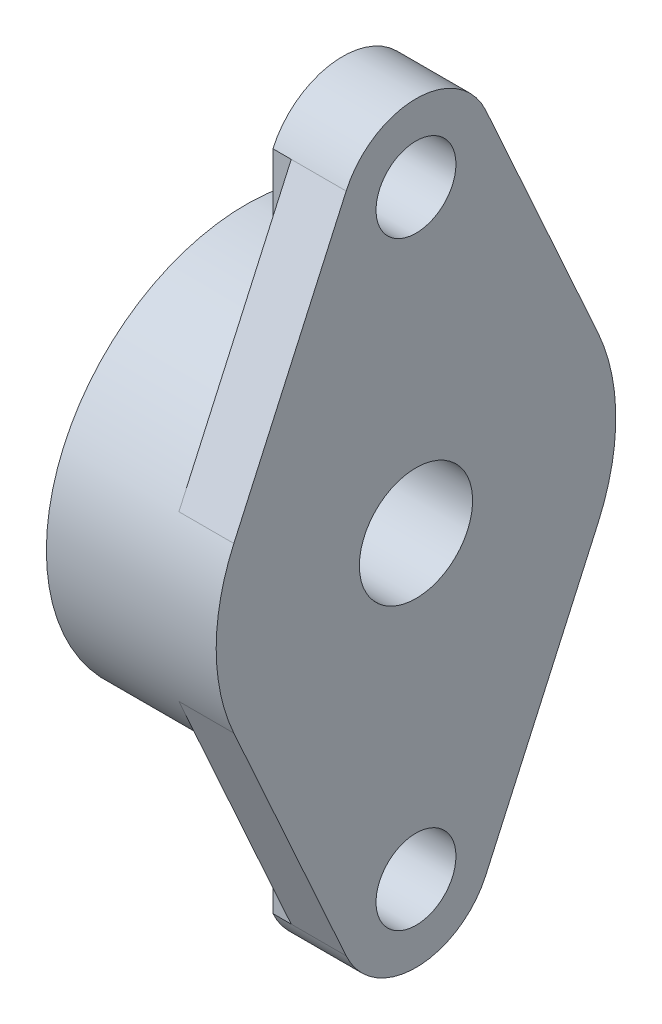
ISO-10303-21;
HEADER;
FILE_DESCRIPTION(('STEP AP214'),'2;1');
FILE_NAME('part.step','',(''),(''),'','','');
FILE_SCHEMA(('AUTOMOTIVE_DESIGN { 1 0 10303 214 1 1 1 1 }'));
ENDSEC;
DATA;
#1=APPLICATION_CONTEXT('core data for automotive mechanical design processes');
#2=APPLICATION_PROTOCOL_DEFINITION('international standard','automotive_design',2000,#1);
#3=PRODUCT_CONTEXT('',#1,'mechanical');
#4=PRODUCT('Part','Part','',(#3));
#5=PRODUCT_RELATED_PRODUCT_CATEGORY('part','',(#4));
#6=PRODUCT_DEFINITION_FORMATION('','',#4);
#7=PRODUCT_DEFINITION_CONTEXT('part definition',#1,'design');
#8=PRODUCT_DEFINITION('design','',#6,#7);
#9=PRODUCT_DEFINITION_SHAPE('','',#8);
#10=(LENGTH_UNIT() NAMED_UNIT(*) SI_UNIT(.MILLI.,.METRE.));
#11=(NAMED_UNIT(*) PLANE_ANGLE_UNIT() SI_UNIT($,.RADIAN.));
#12=(NAMED_UNIT(*) SI_UNIT($,.STERADIAN.) SOLID_ANGLE_UNIT());
#13=UNCERTAINTY_MEASURE_WITH_UNIT(LENGTH_MEASURE(1.E-05),#10,'distance_accuracy_value','');
#14=(GEOMETRIC_REPRESENTATION_CONTEXT(3) GLOBAL_UNCERTAINTY_ASSIGNED_CONTEXT((#13)) GLOBAL_UNIT_ASSIGNED_CONTEXT((#10,
#11,#12)) REPRESENTATION_CONTEXT('',''));
#15=CARTESIAN_POINT('',(0.,0.,0.));
#16=DIRECTION('',(0.,0.,1.));
#17=DIRECTION('',(1.,0.,0.));
#18=AXIS2_PLACEMENT_3D('',#15,#16,#17);
#19=CARTESIAN_POINT('',(-8.25,-49.9521254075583,-27.3475572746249));
#20=DIRECTION('',(-1.,0.,0.));
#21=DIRECTION('',(0.,0.,1.));
#22=AXIS2_PLACEMENT_3D('',#19,#20,#21);
#23=PLANE('',#22);
#24=DIRECTION('',(0.,-1.,0.));
#25=VECTOR('',#24,1.);
#26=CARTESIAN_POINT('',(-8.25,-38.9182643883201,-10.4832302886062));
#27=LINE('',#26,#25);
#28=CARTESIAN_POINT('',(-8.25,-28.1087509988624,-10.4832302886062));
#29=VERTEX_POINT('',#28);
#30=CARTESIAN_POINT('',(-8.25,-49.7277777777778,-10.4832302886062));
#31=VERTEX_POINT('',#30);
#32=EDGE_CURVE('E71',#29,#31,#27,.T.);
#33=ORIENTED_EDGE('',*,*,#32,.F.);
#34=CARTESIAN_POINT('',(-8.25,0.,0.));
#35=DIRECTION('',(-1.,0.,0.));
#36=DIRECTION('',(0.,0.,1.));
#37=AXIS2_PLACEMENT_3D('',#34,#35,#36);
#38=CIRCLE('',#37,30.);
#39=CARTESIAN_POINT('',(-8.25,-12.3365061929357,-27.3461262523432));
#40=VERTEX_POINT('',#39);
#41=EDGE_CURVE('E208',#40,#29,#38,.T.);
#42=ORIENTED_EDGE('',*,*,#41,.F.);
#43=DIRECTION('',(0.,0.911585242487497,-0.411111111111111));
#44=VECTOR('',#43,1.);
#45=CARTESIAN_POINT('',(-8.25,-31.0305555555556,-18.9153937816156));
#46=LINE('',#45,#44);
#47=EDGE_CURVE('E308',#31,#40,#46,.T.);
#48=ORIENTED_EDGE('',*,*,#47,.F.);
#49=EDGE_LOOP('',(#33,#42,#48));
#50=FACE_BOUND('',#49,.T.);
#51=ADVANCED_FACE('F16',(#50),#23,.T.);
#52=CARTESIAN_POINT('',(-11.,-49.7277777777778,-10.4832302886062));
#53=DIRECTION('',(0.,0.,-1.));
#54=DIRECTION('',(0.,1.,0.));
#55=AXIS2_PLACEMENT_3D('',#52,#53,#54);
#56=PLANE('',#55);
#57=DIRECTION('',(0.,-1.,0.));
#58=VECTOR('',#57,1.);
#59=CARTESIAN_POINT('',(-11.,-42.4463317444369,-10.4832302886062));
#60=LINE('',#59,#58);
#61=CARTESIAN_POINT('',(-11.,-28.1087509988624,-10.4832302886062));
#62=VERTEX_POINT('',#61);
#63=CARTESIAN_POINT('',(-11.,-49.7277777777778,-10.4832302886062));
#64=VERTEX_POINT('',#63);
#65=EDGE_CURVE('E65',#62,#64,#60,.T.);
#66=ORIENTED_EDGE('',*,*,#65,.F.);
#67=DIRECTION('',(-1.,0.,0.));
#68=VECTOR('',#67,1.);
#69=CARTESIAN_POINT('',(-12.75,-28.1087509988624,-10.4832302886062));
#70=LINE('',#69,#68);
#71=EDGE_CURVE('E300',#29,#62,#70,.T.);
#72=ORIENTED_EDGE('',*,*,#71,.F.);
#73=ORIENTED_EDGE('',*,*,#32,.T.);
#74=DIRECTION('',(1.,0.,0.));
#75=VECTOR('',#74,1.);
#76=CARTESIAN_POINT('',(-5.5,-49.7277777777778,-10.4832302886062));
#77=LINE('',#76,#75);
#78=EDGE_CURVE('E316',#64,#31,#77,.T.);
#79=ORIENTED_EDGE('',*,*,#78,.F.);
#80=EDGE_LOOP('',(#66,#72,#73,#79));
#81=FACE_BOUND('',#80,.T.);
#82=ADVANCED_FACE('F482',(#81),#56,.T.);
#83=CARTESIAN_POINT('',(-8.25,12.1121584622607,-27.3475572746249));
#84=DIRECTION('',(-1.,0.,0.));
#85=DIRECTION('',(0.,0.,1.));
#86=AXIS2_PLACEMENT_3D('',#83,#84,#85);
#87=PLANE('',#86);
#88=CARTESIAN_POINT('',(-8.25,0.,0.));
#89=DIRECTION('',(-1.,0.,0.));
#90=DIRECTION('',(0.,0.,1.));
#91=AXIS2_PLACEMENT_3D('',#88,#89,#90);
#92=CIRCLE('',#91,30.);
#93=CARTESIAN_POINT('',(-8.25,28.1087509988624,-10.4832302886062));
#94=VERTEX_POINT('',#93);
#95=CARTESIAN_POINT('',(-8.25,12.3365061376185,-27.3461262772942));
#96=VERTEX_POINT('',#95);
#97=EDGE_CURVE('E360',#94,#96,#92,.T.);
#98=ORIENTED_EDGE('',*,*,#97,.F.);
#99=DIRECTION('',(0.,-1.,0.));
#100=VECTOR('',#99,1.);
#101=CARTESIAN_POINT('',(-8.25,38.9182643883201,-10.4832302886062));
#102=LINE('',#101,#100);
#103=CARTESIAN_POINT('',(-8.25,49.7277777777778,-10.4832302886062));
#104=VERTEX_POINT('',#103);
#105=EDGE_CURVE('E270',#104,#94,#102,.T.);
#106=ORIENTED_EDGE('',*,*,#105,.F.);
#107=DIRECTION('',(0.,0.911585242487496,0.411111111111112));
#108=VECTOR('',#107,1.);
#109=CARTESIAN_POINT('',(-8.25,31.0305555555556,-18.9153937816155));
#110=LINE('',#109,#108);
#111=EDGE_CURVE('E203',#96,#104,#110,.T.);
#112=ORIENTED_EDGE('',*,*,#111,.F.);
#113=EDGE_LOOP('',(#98,#106,#112));
#114=FACE_BOUND('',#113,.T.);
#115=ADVANCED_FACE('F371',(#114),#87,.T.);
#116=CARTESIAN_POINT('',(-11.,28.1087509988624,-10.4832302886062));
#117=DIRECTION('',(0.,0.,-1.));
#118=DIRECTION('',(0.,1.,0.));
#119=AXIS2_PLACEMENT_3D('',#116,#117,#118);
#120=PLANE('',#119);
#121=DIRECTION('',(0.,-1.,0.));
#122=VECTOR('',#121,1.);
#123=CARTESIAN_POINT('',(-11.,42.4463317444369,-10.4832302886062));
#124=LINE('',#123,#122);
#125=CARTESIAN_POINT('',(-11.,49.7277777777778,-10.4832302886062));
#126=VERTEX_POINT('',#125);
#127=CARTESIAN_POINT('',(-11.,28.1087509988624,-10.4832302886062));
#128=VERTEX_POINT('',#127);
#129=EDGE_CURVE('E245',#126,#128,#124,.T.);
#130=ORIENTED_EDGE('',*,*,#129,.F.);
#131=DIRECTION('',(-1.,0.,0.));
#132=VECTOR('',#131,1.);
#133=CARTESIAN_POINT('',(-5.5,49.7277777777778,-10.4832302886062));
#134=LINE('',#133,#132);
#135=EDGE_CURVE('E197',#104,#126,#134,.T.);
#136=ORIENTED_EDGE('',*,*,#135,.F.);
#137=ORIENTED_EDGE('',*,*,#105,.T.);
#138=DIRECTION('',(1.,0.,0.));
#139=VECTOR('',#138,1.);
#140=CARTESIAN_POINT('',(-12.75,28.1087509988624,-10.4832302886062));
#141=LINE('',#140,#139);
#142=EDGE_CURVE('E215',#128,#94,#141,.T.);
#143=ORIENTED_EDGE('',*,*,#142,.F.);
#144=EDGE_LOOP('',(#130,#136,#137,#143));
#145=FACE_BOUND('',#144,.T.);
#146=ADVANCED_FACE('F366',(#145),#120,.T.);
#147=CARTESIAN_POINT('',(-11.,-28.1087509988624,10.4832302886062));
#148=DIRECTION('',(0.,0.,1.));
#149=DIRECTION('',(0.,-1.,0.));
#150=AXIS2_PLACEMENT_3D('',#147,#148,#149);
#151=PLANE('',#150);
#152=DIRECTION('',(0.,1.,0.));
#153=VECTOR('',#152,1.);
#154=CARTESIAN_POINT('',(-11.,-42.4463317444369,10.4832302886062));
#155=LINE('',#154,#153);
#156=CARTESIAN_POINT('',(-11.,-49.7277777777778,10.4832302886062));
#157=VERTEX_POINT('',#156);
#158=CARTESIAN_POINT('',(-11.,-28.1087509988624,10.4832302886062));
#159=VERTEX_POINT('',#158);
#160=EDGE_CURVE('E59',#157,#159,#155,.T.);
#161=ORIENTED_EDGE('',*,*,#160,.F.);
#162=DIRECTION('',(-1.,0.,0.));
#163=VECTOR('',#162,1.);
#164=CARTESIAN_POINT('',(-5.5,-49.7277777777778,10.4832302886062));
#165=LINE('',#164,#163);
#166=CARTESIAN_POINT('',(-8.25,-49.7277777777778,10.4832302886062));
#167=VERTEX_POINT('',#166);
#168=EDGE_CURVE('E257',#167,#157,#165,.T.);
#169=ORIENTED_EDGE('',*,*,#168,.F.);
#170=DIRECTION('',(0.,1.,0.));
#171=VECTOR('',#170,1.);
#172=CARTESIAN_POINT('',(-8.25,-49.7277777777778,10.4832302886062));
#173=LINE('',#172,#171);
#174=CARTESIAN_POINT('',(-8.25,-28.1087509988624,10.4832302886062));
#175=VERTEX_POINT('',#174);
#176=EDGE_CURVE('E251',#175,#167,#173,.F.);
#177=ORIENTED_EDGE('',*,*,#176,.F.);
#178=DIRECTION('',(1.,0.,0.));
#179=VECTOR('',#178,1.);
#180=CARTESIAN_POINT('',(-12.75,-28.1087509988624,10.4832302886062));
#181=LINE('',#180,#179);
#182=EDGE_CURVE('E277',#159,#175,#181,.T.);
#183=ORIENTED_EDGE('',*,*,#182,.F.);
#184=EDGE_LOOP('',(#161,#169,#177,#183));
#185=FACE_BOUND('',#184,.T.);
#186=ADVANCED_FACE('F432',(#185),#151,.T.);
#187=CARTESIAN_POINT('',(-8.25,12.1121585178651,10.4832302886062));
#188=DIRECTION('',(-1.,0.,0.));
#189=DIRECTION('',(0.,0.,1.));
#190=AXIS2_PLACEMENT_3D('',#187,#188,#189);
#191=PLANE('',#190);
#192=DIRECTION('',(0.,1.,0.));
#193=VECTOR('',#192,1.);
#194=CARTESIAN_POINT('',(-8.25,38.9182643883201,10.4832302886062));
#195=LINE('',#194,#193);
#196=CARTESIAN_POINT('',(-8.25,28.1087509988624,10.4832302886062));
#197=VERTEX_POINT('',#196);
#198=CARTESIAN_POINT('',(-8.25,49.7277777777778,10.4832302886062));
#199=VERTEX_POINT('',#198);
#200=EDGE_CURVE('E133',#197,#199,#195,.T.);
#201=ORIENTED_EDGE('',*,*,#200,.F.);
#202=CARTESIAN_POINT('',(-8.25,0.,0.));
#203=DIRECTION('',(-1.,0.,0.));
#204=DIRECTION('',(0.,0.,1.));
#205=AXIS2_PLACEMENT_3D('',#202,#203,#204);
#206=CIRCLE('',#205,30.);
#207=CARTESIAN_POINT('',(-8.25,12.3365061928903,27.3461262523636));
#208=VERTEX_POINT('',#207);
#209=EDGE_CURVE('E184',#208,#197,#206,.T.);
#210=ORIENTED_EDGE('',*,*,#209,.F.);
#211=DIRECTION('',(0.,-0.911585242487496,0.411111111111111));
#212=VECTOR('',#211,1.);
#213=CARTESIAN_POINT('',(-8.25,31.0305555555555,18.9153937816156));
#214=LINE('',#213,#212);
#215=EDGE_CURVE('E274',#199,#208,#214,.T.);
#216=ORIENTED_EDGE('',*,*,#215,.F.);
#217=EDGE_LOOP('',(#201,#210,#216));
#218=FACE_BOUND('',#217,.T.);
#219=ADVANCED_FACE('F420',(#218),#191,.T.);
#220=CARTESIAN_POINT('',(-11.,49.7277777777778,10.4832302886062));
#221=DIRECTION('',(0.,0.,1.));
#222=DIRECTION('',(0.,-1.,0.));
#223=AXIS2_PLACEMENT_3D('',#220,#221,#222);
#224=PLANE('',#223);
#225=DIRECTION('',(0.,1.,0.));
#226=VECTOR('',#225,1.);
#227=CARTESIAN_POINT('',(-11.,42.4463317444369,10.4832302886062));
#228=LINE('',#227,#226);
#229=CARTESIAN_POINT('',(-11.,28.1087509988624,10.4832302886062));
#230=VERTEX_POINT('',#229);
#231=CARTESIAN_POINT('',(-11.,49.7277777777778,10.4832302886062));
#232=VERTEX_POINT('',#231);
#233=EDGE_CURVE('E128',#230,#232,#228,.T.);
#234=ORIENTED_EDGE('',*,*,#233,.F.);
#235=DIRECTION('',(-1.,0.,0.));
#236=VECTOR('',#235,1.);
#237=CARTESIAN_POINT('',(-12.75,28.1087509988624,10.4832302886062));
#238=LINE('',#237,#236);
#239=EDGE_CURVE('E267',#197,#230,#238,.T.);
#240=ORIENTED_EDGE('',*,*,#239,.F.);
#241=ORIENTED_EDGE('',*,*,#200,.T.);
#242=DIRECTION('',(1.,0.,0.));
#243=VECTOR('',#242,1.);
#244=CARTESIAN_POINT('',(-5.5,49.7277777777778,10.4832302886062));
#245=LINE('',#244,#243);
#246=EDGE_CURVE('E284',#232,#199,#245,.T.);
#247=ORIENTED_EDGE('',*,*,#246,.F.);
#248=EDGE_LOOP('',(#234,#240,#241,#247));
#249=FACE_BOUND('',#248,.T.);
#250=ADVANCED_FACE('F424',(#249),#224,.T.);
#251=CARTESIAN_POINT('',(-8.25,-49.9521254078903,10.4832302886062));
#252=DIRECTION('',(-1.,0.,0.));
#253=DIRECTION('',(0.,0.,1.));
#254=AXIS2_PLACEMENT_3D('',#251,#252,#253);
#255=PLANE('',#254);
#256=CARTESIAN_POINT('',(-8.25,0.,0.));
#257=DIRECTION('',(-1.,0.,0.));
#258=DIRECTION('',(0.,0.,1.));
#259=AXIS2_PLACEMENT_3D('',#256,#257,#258);
#260=CIRCLE('',#259,30.);
#261=CARTESIAN_POINT('',(-8.25,-12.3365061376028,27.3461262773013));
#262=VERTEX_POINT('',#261);
#263=EDGE_CURVE('E154',#175,#262,#260,.T.);
#264=ORIENTED_EDGE('',*,*,#263,.F.);
#265=ORIENTED_EDGE('',*,*,#176,.T.);
#266=DIRECTION('',(0.,-0.911585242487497,-0.411111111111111));
#267=VECTOR('',#266,1.);
#268=CARTESIAN_POINT('',(-8.25,-31.0305555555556,18.9153937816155));
#269=LINE('',#268,#267);
#270=EDGE_CURVE('E171',#262,#167,#269,.T.);
#271=ORIENTED_EDGE('',*,*,#270,.F.);
#272=EDGE_LOOP('',(#264,#265,#271));
#273=FACE_BOUND('',#272,.T.);
#274=ADVANCED_FACE('F238',(#273),#255,.T.);
#275=CARTESIAN_POINT('',(-11.,28.1087509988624,10.4832302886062));
#276=CARTESIAN_POINT('',(-11.,56.5,10.4832302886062));
#277=CARTESIAN_POINT('',(-11.,56.7839124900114,10.4832302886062));
#278=B_SPLINE_CURVE_WITH_KNOTS('',1,(#275,#276,#277),.UNSPECIFIED.,.F.,.F.,(2,1,2),(0.,1.,1.01),.UNSPECIFIED.);
#279=DIRECTION('',(0.,0.,-1.));
#280=VECTOR('',#279,1.);
#281=SURFACE_OF_LINEAR_EXTRUSION('',#278,#280);
#282=CARTESIAN_POINT('',(-11.,45.,0.));
#283=DIRECTION('',(1.,0.,0.));
#284=DIRECTION('',(0.,0.,-1.));
#285=AXIS2_PLACEMENT_3D('',#282,#283,#284);
#286=CIRCLE('',#285,6.00000000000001);
#287=CARTESIAN_POINT('',(-11.,45.,-6.00000000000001));
#288=VERTEX_POINT('',#287);
#289=EDGE_CURVE('E165',#288,#288,#286,.F.);
#290=ORIENTED_EDGE('',*,*,#289,.F.);
#291=EDGE_LOOP('',(#290));
#292=FACE_BOUND('',#291,.T.);
#293=ORIENTED_EDGE('',*,*,#129,.T.);
#294=CARTESIAN_POINT('',(-11.,0.,0.));
#295=DIRECTION('',(-1.,0.,0.));
#296=DIRECTION('',(0.,0.,1.));
#297=AXIS2_PLACEMENT_3D('',#294,#295,#296);
#298=CIRCLE('',#297,30.);
#299=EDGE_CURVE('E261',#230,#128,#298,.T.);
#300=ORIENTED_EDGE('',*,*,#299,.F.);
#301=ORIENTED_EDGE('',*,*,#233,.T.);
#302=CARTESIAN_POINT('',(-11.,45.,0.));
#303=DIRECTION('',(1.,0.,0.));
#304=DIRECTION('',(0.,0.,-1.));
#305=AXIS2_PLACEMENT_3D('',#302,#303,#304);
#306=CIRCLE('',#305,11.5);
#307=EDGE_CURVE('E288',#126,#232,#306,.T.);
#308=ORIENTED_EDGE('',*,*,#307,.F.);
#309=EDGE_LOOP('',(#293,#300,#301,#308));
#310=FACE_BOUND('',#309,.T.);
#311=ADVANCED_FACE('F232',(#292,#310),#281,.T.);
#312=CARTESIAN_POINT('',(-11.,-56.7839124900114,10.4832302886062));
#313=CARTESIAN_POINT('',(-11.,-56.5,10.4832302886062));
#314=CARTESIAN_POINT('',(-11.,-28.1087509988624,10.4832302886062));
#315=B_SPLINE_CURVE_WITH_KNOTS('',1,(#312,#313,#314),.UNSPECIFIED.,.F.,.F.,(2,1,2),(-0.01,0.,
1.),.UNSPECIFIED.);
#316=DIRECTION('',(0.,0.,-1.));
#317=VECTOR('',#316,1.);
#318=SURFACE_OF_LINEAR_EXTRUSION('',#315,#317);
#319=CARTESIAN_POINT('',(-11.,-45.,0.));
#320=DIRECTION('',(1.,0.,0.));
#321=DIRECTION('',(0.,0.,-1.));
#322=AXIS2_PLACEMENT_3D('',#319,#320,#321);
#323=CIRCLE('',#322,6.);
#324=CARTESIAN_POINT('',(-11.,-45.,-6.));
#325=VERTEX_POINT('',#324);
#326=EDGE_CURVE('E169',#325,#325,#323,.F.);
#327=ORIENTED_EDGE('',*,*,#326,.F.);
#328=EDGE_LOOP('',(#327));
#329=FACE_BOUND('',#328,.T.);
#330=ORIENTED_EDGE('',*,*,#65,.T.);
#331=CARTESIAN_POINT('',(-11.,-45.,0.));
#332=DIRECTION('',(1.,0.,0.));
#333=DIRECTION('',(0.,0.,-1.));
#334=AXIS2_PLACEMENT_3D('',#331,#332,#333);
#335=CIRCLE('',#334,11.5);
#336=EDGE_CURVE('E19',#157,#64,#335,.T.);
#337=ORIENTED_EDGE('',*,*,#336,.F.);
#338=ORIENTED_EDGE('',*,*,#160,.T.);
#339=CARTESIAN_POINT('',(-11.,0.,0.));
#340=DIRECTION('',(-1.,0.,0.));
#341=DIRECTION('',(0.,0.,1.));
#342=AXIS2_PLACEMENT_3D('',#339,#340,#341);
#343=CIRCLE('',#342,30.);
#344=EDGE_CURVE('E353',#62,#159,#343,.T.);
#345=ORIENTED_EDGE('',*,*,#344,.F.);
#346=EDGE_LOOP('',(#330,#337,#338,#345));
#347=FACE_BOUND('',#346,.T.);
#348=ADVANCED_FACE('F227',(#329,#347),#318,.T.);
#349=CARTESIAN_POINT('',(-25.5,-30.,30.3600010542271));
#350=DIRECTION('',(-1.,0.,0.));
#351=DIRECTION('',(0.,1.,0.));
#352=AXIS2_PLACEMENT_3D('',#349,#350,#351);
#353=PLANE('',#352);
#354=CARTESIAN_POINT('',(-25.5,0.,0.));
#355=DIRECTION('',(-1.,0.,0.));
#356=DIRECTION('',(0.,0.,1.));
#357=AXIS2_PLACEMENT_3D('',#354,#355,#356);
#358=CIRCLE('',#357,12.75);
#359=CARTESIAN_POINT('',(-25.5,0.,12.75));
#360=VERTEX_POINT('',#359);
#361=EDGE_CURVE('E344',#360,#360,#358,.T.);
#362=ORIENTED_EDGE('',*,*,#361,.F.);
#363=EDGE_LOOP('',(#362));
#364=FACE_BOUND('',#363,.T.);
#365=CARTESIAN_POINT('',(-25.5,0.,0.));
#366=DIRECTION('',(-1.,0.,0.));
#367=DIRECTION('',(0.,0.,1.));
#368=AXIS2_PLACEMENT_3D('',#365,#366,#367);
#369=CIRCLE('',#368,30.);
#370=CARTESIAN_POINT('',(-25.5,0.,30.));
#371=VERTEX_POINT('',#370);
#372=EDGE_CURVE('E190',#371,#371,#369,.F.);
#373=ORIENTED_EDGE('',*,*,#372,.F.);
#374=EDGE_LOOP('',(#373));
#375=FACE_BOUND('',#374,.T.);
#376=ADVANCED_FACE('F231',(#364,#375),#353,.T.);
#377=CARTESIAN_POINT('',(0.,-45.,0.));
#378=DIRECTION('',(1.,0.,0.));
#379=DIRECTION('',(0.,0.,-1.));
#380=AXIS2_PLACEMENT_3D('',#377,#378,#379);
#381=CYLINDRICAL_SURFACE('',#380,11.5);
#382=ORIENTED_EDGE('',*,*,#336,.T.);
#383=ORIENTED_EDGE('',*,*,#78,.T.);
#384=DIRECTION('',(1.,0.,0.));
#385=VECTOR('',#384,1.);
#386=CARTESIAN_POINT('',(-8.25,-49.7277777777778,-10.4832302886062));
#387=LINE('',#386,#385);
#388=CARTESIAN_POINT('',(0.,-49.7277777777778,-10.4832302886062));
#389=VERTEX_POINT('',#388);
#390=EDGE_CURVE('E212',#389,#31,#387,.F.);
#391=ORIENTED_EDGE('',*,*,#390,.F.);
#392=CARTESIAN_POINT('',(0.,-45.,0.));
#393=DIRECTION('',(1.,0.,0.));
#394=DIRECTION('',(0.,0.,-1.));
#395=AXIS2_PLACEMENT_3D('',#392,#393,#394);
#396=CIRCLE('',#395,11.5);
#397=CARTESIAN_POINT('',(0.,-49.7277777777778,10.4832302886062));
#398=VERTEX_POINT('',#397);
#399=EDGE_CURVE('E341',#398,#389,#396,.T.);
#400=ORIENTED_EDGE('',*,*,#399,.F.);
#401=DIRECTION('',(1.,0.,0.));
#402=VECTOR('',#401,1.);
#403=CARTESIAN_POINT('',(-8.25,-49.7277777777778,10.4832302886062));
#404=LINE('',#403,#402);
#405=EDGE_CURVE('E166',#167,#398,#404,.T.);
#406=ORIENTED_EDGE('',*,*,#405,.F.);
#407=ORIENTED_EDGE('',*,*,#168,.T.);
#408=EDGE_LOOP('',(#382,#383,#391,#400,#406,#407));
#409=FACE_BOUND('',#408,.T.);
#410=ADVANCED_FACE('F454',(#409),#381,.T.);
#411=CARTESIAN_POINT('',(-8.25,-49.7277777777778,-10.4832302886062));
#412=DIRECTION('',(0.,-0.411111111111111,-0.911585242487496));
#413=DIRECTION('',(0.,0.911585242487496,-0.411111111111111));
#414=AXIS2_PLACEMENT_3D('',#411,#412,#413);
#415=PLANE('',#414);
#416=CARTESIAN_POINT('',(0.,-49.7277777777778,-10.4832302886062));
#417=CARTESIAN_POINT('',(0.,-48.1696759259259,-11.1859105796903));
#418=CARTESIAN_POINT('',(0.,-46.6115740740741,-11.8885908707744));
#419=CARTESIAN_POINT('',(0.,-43.4953703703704,-13.2939514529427));
#420=CARTESIAN_POINT('',(0.,-41.9372685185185,-13.9966317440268));
#421=CARTESIAN_POINT('',(0.,-38.8210648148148,-15.401992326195));
#422=CARTESIAN_POINT('',(0.,-37.262962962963,-16.1046726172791));
#423=CARTESIAN_POINT('',(0.,-34.1467592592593,-17.5100331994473));
#424=CARTESIAN_POINT('',(0.,-32.5886574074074,-18.2127134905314));
#425=CARTESIAN_POINT('',(0.,-29.4724537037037,-19.6180740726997));
#426=CARTESIAN_POINT('',(0.,-27.9143518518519,-20.3207543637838));
#427=CARTESIAN_POINT('',(0.,-24.7981481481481,-21.726114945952));
#428=CARTESIAN_POINT('',(0.,-23.2400462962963,-22.4287952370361));
#429=CARTESIAN_POINT('',(0.,-20.1238425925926,-23.8341558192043));
#430=CARTESIAN_POINT('',(0.,-18.5657407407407,-24.5368361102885));
#431=CARTESIAN_POINT('',(0.,-15.449537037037,-25.9421966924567));
#432=CARTESIAN_POINT('',(0.,-13.8914351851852,-26.6448769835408));
#433=CARTESIAN_POINT('',(0.,-12.3333333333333,-27.3475572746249));
#434=B_SPLINE_CURVE_WITH_KNOTS('',3,(#416,#417,#418,#419,#420,#421,#422,#423,#424,#425,#426,
#427,#428,#429,#430,#431,#432,#433),.UNSPECIFIED.,.F.,.F.,(4,2,2,2,2,2,2,2,4),(0.,
5.12766698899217,10.2553339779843,15.3830009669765,20.5106679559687,25.6383349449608,
30.766001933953,35.8936689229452,41.0213359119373),.UNSPECIFIED.);
#435=CARTESIAN_POINT('',(0.,-12.3333333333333,-27.3475572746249));
#436=VERTEX_POINT('',#435);
#437=EDGE_CURVE('E340',#389,#436,#434,.T.);
#438=ORIENTED_EDGE('',*,*,#437,.F.);
#439=ORIENTED_EDGE('',*,*,#390,.T.);
#440=ORIENTED_EDGE('',*,*,#47,.T.);
#441=CARTESIAN_POINT('',(-8.25,-12.3333333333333,-27.3475572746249));
#442=VERTEX_POINT('',#441);
#443=EDGE_CURVE('E34',#40,#442,#46,.T.);
#444=ORIENTED_EDGE('',*,*,#443,.T.);
#445=DIRECTION('',(-1.,0.,0.));
#446=VECTOR('',#445,1.);
#447=CARTESIAN_POINT('',(-12.75,-12.3333333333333,-27.3475572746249));
#448=LINE('',#447,#446);
#449=EDGE_CURVE('E206',#436,#442,#448,.T.);
#450=ORIENTED_EDGE('',*,*,#449,.F.);
#451=EDGE_LOOP('',(#438,#439,#440,#444,#450));
#452=FACE_BOUND('',#451,.T.);
#453=ADVANCED_FACE('F472',(#452),#415,.T.);
#454=CARTESIAN_POINT('',(-8.25,12.3333333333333,-27.3475572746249));
#455=DIRECTION('',(0.,0.411111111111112,-0.911585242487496));
#456=DIRECTION('',(0.,0.911585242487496,0.411111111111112));
#457=AXIS2_PLACEMENT_3D('',#454,#455,#456);
#458=PLANE('',#457);
#459=CARTESIAN_POINT('',(0.,12.3333333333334,-27.3475572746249));
#460=CARTESIAN_POINT('',(0.,13.8914351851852,-26.6448769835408));
#461=CARTESIAN_POINT('',(0.,15.4495370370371,-25.9421966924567));
#462=CARTESIAN_POINT('',(0.,18.5657407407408,-24.5368361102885));
#463=CARTESIAN_POINT('',(0.,20.1238425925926,-23.8341558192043));
#464=CARTESIAN_POINT('',(0.,23.2400462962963,-22.4287952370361));
#465=CARTESIAN_POINT('',(0.,24.7981481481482,-21.726114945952));
#466=CARTESIAN_POINT('',(0.,27.9143518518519,-20.3207543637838));
#467=CARTESIAN_POINT('',(0.,29.4724537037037,-19.6180740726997));
#468=CARTESIAN_POINT('',(0.,32.5886574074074,-18.2127134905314));
#469=CARTESIAN_POINT('',(0.,34.1467592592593,-17.5100331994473));
#470=CARTESIAN_POINT('',(0.,37.262962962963,-16.1046726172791));
#471=CARTESIAN_POINT('',(0.,38.8210648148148,-15.401992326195));
#472=CARTESIAN_POINT('',(0.,41.9372685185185,-13.9966317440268));
#473=CARTESIAN_POINT('',(0.,43.4953703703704,-13.2939514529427));
#474=CARTESIAN_POINT('',(0.,46.6115740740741,-11.8885908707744));
#475=CARTESIAN_POINT('',(0.,48.1696759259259,-11.1859105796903));
#476=CARTESIAN_POINT('',(0.,49.7277777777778,-10.4832302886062));
#477=B_SPLINE_CURVE_WITH_KNOTS('',3,(#459,#460,#461,#462,#463,#464,#465,#466,#467,#468,#469,
#470,#471,#472,#473,#474,#475,#476),.UNSPECIFIED.,.F.,.F.,(4,2,2,2,2,2,2,2,4),(0.,
5.12766698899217,10.2553339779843,15.3830009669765,20.5106679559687,25.6383349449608,
30.766001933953,35.8936689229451,41.0213359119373),.UNSPECIFIED.);
#478=CARTESIAN_POINT('',(0.,12.3333333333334,-27.3475572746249));
#479=VERTEX_POINT('',#478);
#480=CARTESIAN_POINT('',(0.,49.7277777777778,-10.4832302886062));
#481=VERTEX_POINT('',#480);
#482=EDGE_CURVE('E336',#479,#481,#477,.T.);
#483=ORIENTED_EDGE('',*,*,#482,.F.);
#484=DIRECTION('',(1.,0.,0.));
#485=VECTOR('',#484,1.);
#486=CARTESIAN_POINT('',(-8.25,12.3333333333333,-27.3475572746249));
#487=LINE('',#486,#485);
#488=CARTESIAN_POINT('',(-8.25,12.3333333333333,-27.3475572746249));
#489=VERTEX_POINT('',#488);
#490=EDGE_CURVE('E198',#479,#489,#487,.F.);
#491=ORIENTED_EDGE('',*,*,#490,.T.);
#492=CARTESIAN_POINT('',(-8.25,0.,0.));
#493=DIRECTION('',(-1.,0.,0.));
#494=DIRECTION('',(0.,1.,0.));
#495=AXIS2_PLACEMENT_3D('',#492,#493,#494);
#496=CIRCLE('',#495,30.);
#497=EDGE_CURVE('E209',#96,#489,#496,.T.);
#498=ORIENTED_EDGE('',*,*,#497,.F.);
#499=ORIENTED_EDGE('',*,*,#111,.T.);
#500=DIRECTION('',(-1.,0.,0.));
#501=VECTOR('',#500,1.);
#502=CARTESIAN_POINT('',(-5.5,49.7277777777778,-10.4832302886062));
#503=LINE('',#502,#501);
#504=EDGE_CURVE('E194',#481,#104,#503,.T.);
#505=ORIENTED_EDGE('',*,*,#504,.F.);
#506=EDGE_LOOP('',(#483,#491,#498,#499,#505));
#507=FACE_BOUND('',#506,.T.);
#508=ADVANCED_FACE('F374',(#507),#458,.T.);
#509=CARTESIAN_POINT('',(0.,45.,0.));
#510=DIRECTION('',(1.,0.,0.));
#511=DIRECTION('',(0.,0.,-1.));
#512=AXIS2_PLACEMENT_3D('',#509,#510,#511);
#513=CYLINDRICAL_SURFACE('',#512,11.5);
#514=ORIENTED_EDGE('',*,*,#307,.T.);
#515=ORIENTED_EDGE('',*,*,#246,.T.);
#516=DIRECTION('',(1.,0.,0.));
#517=VECTOR('',#516,1.);
#518=CARTESIAN_POINT('',(-8.25,49.7277777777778,10.4832302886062));
#519=LINE('',#518,#517);
#520=CARTESIAN_POINT('',(0.,49.7277777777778,10.4832302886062));
#521=VERTEX_POINT('',#520);
#522=EDGE_CURVE('E187',#521,#199,#519,.F.);
#523=ORIENTED_EDGE('',*,*,#522,.F.);
#524=CARTESIAN_POINT('',(0.,45.,0.));
#525=DIRECTION('',(1.,0.,0.));
#526=DIRECTION('',(0.,0.,-1.));
#527=AXIS2_PLACEMENT_3D('',#524,#525,#526);
#528=CIRCLE('',#527,11.5);
#529=EDGE_CURVE('E333',#481,#521,#528,.T.);
#530=ORIENTED_EDGE('',*,*,#529,.F.);
#531=ORIENTED_EDGE('',*,*,#504,.T.);
#532=ORIENTED_EDGE('',*,*,#135,.T.);
#533=EDGE_LOOP('',(#514,#515,#523,#530,#531,#532));
#534=FACE_BOUND('',#533,.T.);
#535=ADVANCED_FACE('F423',(#534),#513,.T.);
#536=CARTESIAN_POINT('',(-8.25,49.7277777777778,10.4832302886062));
#537=DIRECTION('',(0.,0.411111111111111,0.911585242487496));
#538=DIRECTION('',(0.,-0.911585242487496,0.411111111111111));
#539=AXIS2_PLACEMENT_3D('',#536,#537,#538);
#540=PLANE('',#539);
#541=CARTESIAN_POINT('',(0.,49.7277777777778,10.4832302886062));
#542=CARTESIAN_POINT('',(0.,48.1696759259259,11.1859105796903));
#543=CARTESIAN_POINT('',(0.,46.6115740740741,11.8885908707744));
#544=CARTESIAN_POINT('',(0.,43.4953703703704,13.2939514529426));
#545=CARTESIAN_POINT('',(0.,41.9372685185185,13.9966317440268));
#546=CARTESIAN_POINT('',(0.,38.8210648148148,15.401992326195));
#547=CARTESIAN_POINT('',(0.,37.262962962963,16.1046726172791));
#548=CARTESIAN_POINT('',(0.,34.1467592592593,17.5100331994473));
#549=CARTESIAN_POINT('',(0.,32.5886574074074,18.2127134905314));
#550=CARTESIAN_POINT('',(0.,29.4724537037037,19.6180740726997));
#551=CARTESIAN_POINT('',(0.,27.9143518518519,20.3207543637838));
#552=CARTESIAN_POINT('',(0.,24.7981481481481,21.726114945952));
#553=CARTESIAN_POINT('',(0.,23.2400462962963,22.4287952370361));
#554=CARTESIAN_POINT('',(0.,20.1238425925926,23.8341558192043));
#555=CARTESIAN_POINT('',(0.,18.5657407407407,24.5368361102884));
#556=CARTESIAN_POINT('',(0.,15.449537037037,25.9421966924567));
#557=CARTESIAN_POINT('',(0.,13.8914351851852,26.6448769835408));
#558=CARTESIAN_POINT('',(0.,12.3333333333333,27.3475572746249));
#559=B_SPLINE_CURVE_WITH_KNOTS('',3,(#541,#542,#543,#544,#545,#546,#547,#548,#549,#550,#551,
#552,#553,#554,#555,#556,#557,#558),.UNSPECIFIED.,.F.,.F.,(4,2,2,2,2,2,2,2,4),(0.,
5.12766698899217,10.2553339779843,15.3830009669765,20.5106679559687,25.6383349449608,
30.766001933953,35.8936689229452,41.0213359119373),.UNSPECIFIED.);
#560=CARTESIAN_POINT('',(0.,12.3333333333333,27.3475572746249));
#561=VERTEX_POINT('',#560);
#562=EDGE_CURVE('E332',#521,#561,#559,.T.);
#563=ORIENTED_EDGE('',*,*,#562,.F.);
#564=ORIENTED_EDGE('',*,*,#522,.T.);
#565=ORIENTED_EDGE('',*,*,#215,.T.);
#566=CARTESIAN_POINT('',(-8.25,12.3333333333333,27.3475572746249));
#567=VERTEX_POINT('',#566);
#568=EDGE_CURVE('E191',#208,#567,#214,.T.);
#569=ORIENTED_EDGE('',*,*,#568,.T.);
#570=DIRECTION('',(-1.,0.,0.));
#571=VECTOR('',#570,1.);
#572=CARTESIAN_POINT('',(-12.75,12.3333333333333,27.3475572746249));
#573=LINE('',#572,#571);
#574=EDGE_CURVE('E158',#561,#567,#573,.T.);
#575=ORIENTED_EDGE('',*,*,#574,.F.);
#576=EDGE_LOOP('',(#563,#564,#565,#569,#575));
#577=FACE_BOUND('',#576,.T.);
#578=ADVANCED_FACE('F417',(#577),#540,.T.);
#579=CARTESIAN_POINT('',(-25.5,0.,0.));
#580=DIRECTION('',(-1.,0.,0.));
#581=DIRECTION('',(0.,0.,1.));
#582=AXIS2_PLACEMENT_3D('',#579,#580,#581);
#583=CYLINDRICAL_SURFACE('',#582,30.);
#584=ORIENTED_EDGE('',*,*,#372,.T.);
#585=EDGE_LOOP('',(#584));
#586=FACE_BOUND('',#585,.T.);
#587=ORIENTED_EDGE('',*,*,#239,.T.);
#588=ORIENTED_EDGE('',*,*,#299,.T.);
#589=ORIENTED_EDGE('',*,*,#142,.T.);
#590=ORIENTED_EDGE('',*,*,#97,.T.);
#591=ORIENTED_EDGE('',*,*,#497,.T.);
#592=ORIENTED_EDGE('',*,*,#490,.F.);
#593=CARTESIAN_POINT('',(0.,0.,0.));
#594=DIRECTION('',(-1.,0.,0.));
#595=DIRECTION('',(0.,0.,1.));
#596=AXIS2_PLACEMENT_3D('',#593,#594,#595);
#597=CIRCLE('',#596,30.);
#598=EDGE_CURVE('E337',#436,#479,#597,.F.);
#599=ORIENTED_EDGE('',*,*,#598,.F.);
#600=ORIENTED_EDGE('',*,*,#449,.T.);
#601=ORIENTED_EDGE('',*,*,#443,.F.);
#602=ORIENTED_EDGE('',*,*,#41,.T.);
#603=ORIENTED_EDGE('',*,*,#71,.T.);
#604=ORIENTED_EDGE('',*,*,#344,.T.);
#605=ORIENTED_EDGE('',*,*,#182,.T.);
#606=ORIENTED_EDGE('',*,*,#263,.T.);
#607=CARTESIAN_POINT('',(-8.25,0.,0.));
#608=DIRECTION('',(-1.,0.,0.));
#609=DIRECTION('',(0.,1.,0.));
#610=AXIS2_PLACEMENT_3D('',#607,#608,#609);
#611=CIRCLE('',#610,30.);
#612=CARTESIAN_POINT('',(-8.25,-12.3333333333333,27.3475572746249));
#613=VERTEX_POINT('',#612);
#614=EDGE_CURVE('E145',#262,#613,#611,.T.);
#615=ORIENTED_EDGE('',*,*,#614,.T.);
#616=DIRECTION('',(1.,0.,0.));
#617=VECTOR('',#616,1.);
#618=CARTESIAN_POINT('',(-8.25,-12.3333333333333,27.3475572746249));
#619=LINE('',#618,#617);
#620=CARTESIAN_POINT('',(0.,-12.3333333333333,27.3475572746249));
#621=VERTEX_POINT('',#620);
#622=EDGE_CURVE('E150',#621,#613,#619,.F.);
#623=ORIENTED_EDGE('',*,*,#622,.F.);
#624=CARTESIAN_POINT('',(0.,0.,0.));
#625=DIRECTION('',(-1.,0.,0.));
#626=DIRECTION('',(0.,0.,1.));
#627=AXIS2_PLACEMENT_3D('',#624,#625,#626);
#628=CIRCLE('',#627,30.);
#629=EDGE_CURVE('E330',#561,#621,#628,.F.);
#630=ORIENTED_EDGE('',*,*,#629,.F.);
#631=ORIENTED_EDGE('',*,*,#574,.T.);
#632=ORIENTED_EDGE('',*,*,#568,.F.);
#633=ORIENTED_EDGE('',*,*,#209,.T.);
#634=EDGE_LOOP('',(#587,#588,#589,#590,#591,#592,#599,#600,#601,#602,#603,#604,#605,#606,#615,
#623,#630,#631,#632,#633));
#635=FACE_BOUND('',#634,.T.);
#636=ADVANCED_FACE('F148',(#586,#635),#583,.T.);
#637=CARTESIAN_POINT('',(-8.25,-12.3333333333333,27.3475572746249));
#638=DIRECTION('',(0.,-0.411111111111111,0.911585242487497));
#639=DIRECTION('',(0.,-0.911585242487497,-0.411111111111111));
#640=AXIS2_PLACEMENT_3D('',#637,#638,#639);
#641=PLANE('',#640);
#642=CARTESIAN_POINT('',(0.,-12.3333333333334,27.3475572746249));
#643=CARTESIAN_POINT('',(0.,-13.8914351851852,26.6448769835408));
#644=CARTESIAN_POINT('',(0.,-15.4495370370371,25.9421966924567));
#645=CARTESIAN_POINT('',(0.,-18.5657407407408,24.5368361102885));
#646=CARTESIAN_POINT('',(0.,-20.1238425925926,23.8341558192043));
#647=CARTESIAN_POINT('',(0.,-23.2400462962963,22.4287952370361));
#648=CARTESIAN_POINT('',(0.,-24.7981481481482,21.726114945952));
#649=CARTESIAN_POINT('',(0.,-27.9143518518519,20.3207543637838));
#650=CARTESIAN_POINT('',(0.,-29.4724537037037,19.6180740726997));
#651=CARTESIAN_POINT('',(0.,-32.5886574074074,18.2127134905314));
#652=CARTESIAN_POINT('',(0.,-34.1467592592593,17.5100331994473));
#653=CARTESIAN_POINT('',(0.,-37.262962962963,16.1046726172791));
#654=CARTESIAN_POINT('',(0.,-38.8210648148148,15.401992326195));
#655=CARTESIAN_POINT('',(0.,-41.9372685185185,13.9966317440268));
#656=CARTESIAN_POINT('',(0.,-43.4953703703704,13.2939514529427));
#657=CARTESIAN_POINT('',(0.,-46.6115740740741,11.8885908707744));
#658=CARTESIAN_POINT('',(0.,-48.1696759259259,11.1859105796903));
#659=CARTESIAN_POINT('',(0.,-49.7277777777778,10.4832302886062));
#660=B_SPLINE_CURVE_WITH_KNOTS('',3,(#642,#643,#644,#645,#646,#647,#648,#649,#650,#651,#652,
#653,#654,#655,#656,#657,#658,#659),.UNSPECIFIED.,.F.,.F.,(4,2,2,2,2,2,2,2,4),(0.,
5.12766698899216,10.2553339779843,15.3830009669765,20.5106679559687,25.6383349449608,
30.766001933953,35.8936689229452,41.0213359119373),.UNSPECIFIED.);
#661=EDGE_CURVE('E163',#621,#398,#660,.T.);
#662=ORIENTED_EDGE('',*,*,#661,.F.);
#663=ORIENTED_EDGE('',*,*,#622,.T.);
#664=ORIENTED_EDGE('',*,*,#614,.F.);
#665=ORIENTED_EDGE('',*,*,#270,.T.);
#666=ORIENTED_EDGE('',*,*,#405,.T.);
#667=EDGE_LOOP('',(#662,#663,#664,#665,#666));
#668=FACE_BOUND('',#667,.T.);
#669=ADVANCED_FACE('F160',(#668),#641,.T.);
#670=CARTESIAN_POINT('',(-11.,45.,0.));
#671=DIRECTION('',(1.,0.,0.));
#672=DIRECTION('',(0.,0.,-1.));
#673=AXIS2_PLACEMENT_3D('',#670,#671,#672);
#674=CYLINDRICAL_SURFACE('',#673,6.00000000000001);
#675=CARTESIAN_POINT('',(0.,45.,0.));
#676=DIRECTION('',(1.,0.,0.));
#677=DIRECTION('',(0.,0.,-1.));
#678=AXIS2_PLACEMENT_3D('',#675,#676,#677);
#679=CIRCLE('',#678,6.00000000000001);
#680=CARTESIAN_POINT('',(0.,45.,-6.00000000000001));
#681=VERTEX_POINT('',#680);
#682=EDGE_CURVE('E327',#681,#681,#679,.F.);
#683=ORIENTED_EDGE('',*,*,#682,.F.);
#684=EDGE_LOOP('',(#683));
#685=FACE_BOUND('',#684,.T.);
#686=ORIENTED_EDGE('',*,*,#289,.T.);
#687=EDGE_LOOP('',(#686));
#688=FACE_BOUND('',#687,.T.);
#689=ADVANCED_FACE('F463',(#685,#688),#674,.F.);
#690=CARTESIAN_POINT('',(-11.,-45.,0.));
#691=DIRECTION('',(1.,0.,0.));
#692=DIRECTION('',(0.,0.,-1.));
#693=AXIS2_PLACEMENT_3D('',#690,#691,#692);
#694=CYLINDRICAL_SURFACE('',#693,6.);
#695=CARTESIAN_POINT('',(0.,-45.,0.));
#696=DIRECTION('',(1.,0.,0.));
#697=DIRECTION('',(0.,0.,-1.));
#698=AXIS2_PLACEMENT_3D('',#695,#696,#697);
#699=CIRCLE('',#698,6.);
#700=CARTESIAN_POINT('',(0.,-45.,-6.));
#701=VERTEX_POINT('',#700);
#702=EDGE_CURVE('E324',#701,#701,#699,.F.);
#703=ORIENTED_EDGE('',*,*,#702,.F.);
#704=EDGE_LOOP('',(#703));
#705=FACE_BOUND('',#704,.T.);
#706=ORIENTED_EDGE('',*,*,#326,.T.);
#707=EDGE_LOOP('',(#706));
#708=FACE_BOUND('',#707,.T.);
#709=ADVANCED_FACE('F449',(#705,#708),#694,.F.);
#710=CARTESIAN_POINT('',(-33.3,0.,0.));
#711=DIRECTION('',(-1.,0.,0.));
#712=DIRECTION('',(0.,0.,1.));
#713=AXIS2_PLACEMENT_3D('',#710,#711,#712);
#714=CYLINDRICAL_SURFACE('',#713,12.75);
#715=CARTESIAN_POINT('',(-33.3,0.,0.));
#716=DIRECTION('',(-1.,0.,0.));
#717=DIRECTION('',(0.,0.,1.));
#718=AXIS2_PLACEMENT_3D('',#715,#716,#717);
#719=CIRCLE('',#718,12.75);
#720=CARTESIAN_POINT('',(-33.3,0.,12.75));
#721=VERTEX_POINT('',#720);
#722=EDGE_CURVE('E321',#721,#721,#719,.T.);
#723=ORIENTED_EDGE('',*,*,#722,.F.);
#724=EDGE_LOOP('',(#723));
#725=FACE_BOUND('',#724,.T.);
#726=ORIENTED_EDGE('',*,*,#361,.T.);
#727=EDGE_LOOP('',(#726));
#728=FACE_BOUND('',#727,.T.);
#729=ADVANCED_FACE('F401',(#725,#728),#714,.T.);
#730=CARTESIAN_POINT('',(0.,57.6413,30.));
#731=CARTESIAN_POINT('',(0.,56.5,30.));
#732=CARTESIAN_POINT('',(0.,-56.5,30.));
#733=CARTESIAN_POINT('',(0.,-57.63,30.));
#734=B_SPLINE_CURVE_WITH_KNOTS('',1,(#730,#731,#732,#733),.UNSPECIFIED.,.F.,.F.,(2,1,1,2),
(-0.0101,0.,1.,1.01),.UNSPECIFIED.);
#735=DIRECTION('',(0.,0.,-1.));
#736=VECTOR('',#735,1.);
#737=SURFACE_OF_LINEAR_EXTRUSION('',#734,#736);
#738=CARTESIAN_POINT('',(0.,0.,0.));
#739=DIRECTION('',(-1.,0.,0.));
#740=DIRECTION('',(0.,0.,1.));
#741=AXIS2_PLACEMENT_3D('',#738,#739,#740);
#742=CIRCLE('',#741,8.5);
#743=CARTESIAN_POINT('',(0.,0.,8.5));
#744=VERTEX_POINT('',#743);
#745=EDGE_CURVE('E25',#744,#744,#742,.F.);
#746=ORIENTED_EDGE('',*,*,#745,.F.);
#747=EDGE_LOOP('',(#746));
#748=FACE_BOUND('',#747,.T.);
#749=ORIENTED_EDGE('',*,*,#702,.T.);
#750=EDGE_LOOP('',(#749));
#751=FACE_BOUND('',#750,.T.);
#752=ORIENTED_EDGE('',*,*,#682,.T.);
#753=EDGE_LOOP('',(#752));
#754=FACE_BOUND('',#753,.T.);
#755=ORIENTED_EDGE('',*,*,#629,.T.);
#756=ORIENTED_EDGE('',*,*,#661,.T.);
#757=ORIENTED_EDGE('',*,*,#399,.T.);
#758=ORIENTED_EDGE('',*,*,#437,.T.);
#759=ORIENTED_EDGE('',*,*,#598,.T.);
#760=ORIENTED_EDGE('',*,*,#482,.T.);
#761=ORIENTED_EDGE('',*,*,#529,.T.);
#762=ORIENTED_EDGE('',*,*,#562,.T.);
#763=EDGE_LOOP('',(#755,#756,#757,#758,#759,#760,#761,#762));
#764=FACE_BOUND('',#763,.T.);
#765=ADVANCED_FACE('F381',(#748,#751,#754,#764),#737,.T.);
#766=CARTESIAN_POINT('',(-33.3,-12.75,12.9030021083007));
#767=DIRECTION('',(-1.,0.,0.));
#768=DIRECTION('',(0.,1.,0.));
#769=AXIS2_PLACEMENT_3D('',#766,#767,#768);
#770=PLANE('',#769);
#771=CARTESIAN_POINT('',(-33.3,0.,0.));
#772=DIRECTION('',(-1.,0.,0.));
#773=DIRECTION('',(0.,0.,1.));
#774=AXIS2_PLACEMENT_3D('',#771,#772,#773);
#775=CIRCLE('',#774,8.5);
#776=CARTESIAN_POINT('',(-33.3,0.,8.5));
#777=VERTEX_POINT('',#776);
#778=EDGE_CURVE('E10',#777,#777,#775,.T.);
#779=ORIENTED_EDGE('',*,*,#778,.F.);
#780=EDGE_LOOP('',(#779));
#781=FACE_BOUND('',#780,.T.);
#782=ORIENTED_EDGE('',*,*,#722,.T.);
#783=EDGE_LOOP('',(#782));
#784=FACE_BOUND('',#783,.T.);
#785=ADVANCED_FACE('F400',(#781,#784),#770,.T.);
#786=CARTESIAN_POINT('',(0.,0.,0.));
#787=DIRECTION('',(-1.,0.,0.));
#788=DIRECTION('',(0.,0.,1.));
#789=AXIS2_PLACEMENT_3D('',#786,#787,#788);
#790=CYLINDRICAL_SURFACE('',#789,8.5);
#791=ORIENTED_EDGE('',*,*,#745,.T.);
#792=EDGE_LOOP('',(#791));
#793=FACE_BOUND('',#792,.T.);
#794=ORIENTED_EDGE('',*,*,#778,.T.);
#795=EDGE_LOOP('',(#794));
#796=FACE_BOUND('',#795,.T.);
#797=ADVANCED_FACE('F434',(#793,#796),#790,.F.);
#798=CLOSED_SHELL('',(#51,#82,#115,#146,#186,#219,#250,#274,#311,#348,#376,#410,#453,#508,#535,
#578,#636,#669,#689,#709,#729,#765,#785,#797));
#799=MANIFOLD_SOLID_BREP('B1',#798);
#800=ADVANCED_BREP_SHAPE_REPRESENTATION('',(#18,#799),#14);
#801=SHAPE_DEFINITION_REPRESENTATION(#9,#800);
ENDSEC;
END-ISO-10303-21;
